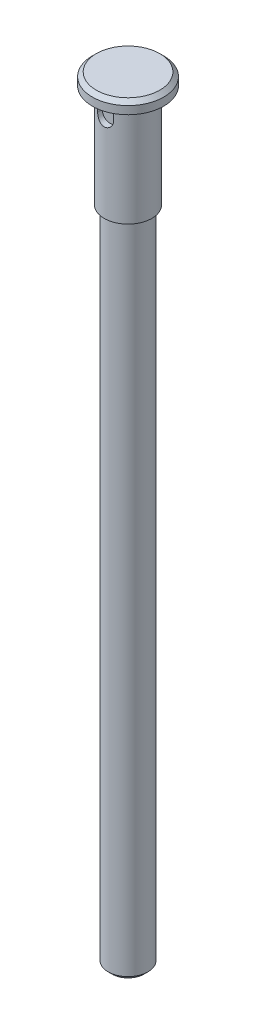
ISO-10303-21;
HEADER;
FILE_DESCRIPTION(('STEP AP214'),'2;1');
FILE_NAME('part.step','',(''),(''),'','','');
FILE_SCHEMA(('AUTOMOTIVE_DESIGN { 1 0 10303 214 1 1 1 1 }'));
ENDSEC;
DATA;
#1=APPLICATION_CONTEXT('core data for automotive mechanical design processes');
#2=APPLICATION_PROTOCOL_DEFINITION('international standard','automotive_design',2000,#1);
#3=PRODUCT_CONTEXT('',#1,'mechanical');
#4=PRODUCT('Part','Part','',(#3));
#5=PRODUCT_RELATED_PRODUCT_CATEGORY('part','',(#4));
#6=PRODUCT_DEFINITION_FORMATION('','',#4);
#7=PRODUCT_DEFINITION_CONTEXT('part definition',#1,'design');
#8=PRODUCT_DEFINITION('design','',#6,#7);
#9=PRODUCT_DEFINITION_SHAPE('','',#8);
#10=(LENGTH_UNIT() NAMED_UNIT(*) SI_UNIT(.MILLI.,.METRE.));
#11=(NAMED_UNIT(*) PLANE_ANGLE_UNIT() SI_UNIT($,.RADIAN.));
#12=(NAMED_UNIT(*) SI_UNIT($,.STERADIAN.) SOLID_ANGLE_UNIT());
#13=UNCERTAINTY_MEASURE_WITH_UNIT(LENGTH_MEASURE(1.E-05),#10,'distance_accuracy_value','');
#14=(GEOMETRIC_REPRESENTATION_CONTEXT(3) GLOBAL_UNCERTAINTY_ASSIGNED_CONTEXT((#13)) GLOBAL_UNIT_ASSIGNED_CONTEXT((#10,
#11,#12)) REPRESENTATION_CONTEXT('',''));
#15=CARTESIAN_POINT('',(0.,0.,0.));
#16=DIRECTION('',(0.,0.,1.));
#17=DIRECTION('',(1.,0.,0.));
#18=AXIS2_PLACEMENT_3D('',#15,#16,#17);
#19=CARTESIAN_POINT('',(0.,0.,0.));
#20=DIRECTION('',(0.,1.,0.));
#21=DIRECTION('',(0.,0.,1.));
#22=AXIS2_PLACEMENT_3D('',#19,#20,#21);
#23=PLANE('',#22);
#24=CARTESIAN_POINT('',(0.,0.,0.));
#25=DIRECTION('',(0.,-1.,0.));
#26=DIRECTION('',(0.,0.,-1.));
#27=AXIS2_PLACEMENT_3D('',#24,#25,#26);
#28=CIRCLE('',#27,4.);
#29=CARTESIAN_POINT('',(0.,0.,-4.));
#30=VERTEX_POINT('',#29);
#31=EDGE_CURVE('E472',#30,#30,#28,.T.);
#32=ORIENTED_EDGE('',*,*,#31,.T.);
#33=EDGE_LOOP('',(#32));
#34=FACE_BOUND('',#33,.T.);
#35=ADVANCED_FACE('F350',(#34),#23,.F.);
#36=CARTESIAN_POINT('',(0.,0.999999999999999,0.));
#37=DIRECTION('',(0.,1.,0.));
#38=DIRECTION('',(0.,0.,1.));
#39=AXIS2_PLACEMENT_3D('',#36,#37,#38);
#40=CONICAL_SURFACE('',#39,5.,0.785398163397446);
#41=ORIENTED_EDGE('',*,*,#31,.F.);
#42=EDGE_LOOP('',(#41));
#43=FACE_BOUND('',#42,.T.);
#44=CARTESIAN_POINT('',(0.,0.999999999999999,0.));
#45=DIRECTION('',(0.,-1.,0.));
#46=DIRECTION('',(0.,0.,-1.));
#47=AXIS2_PLACEMENT_3D('',#44,#45,#46);
#48=CIRCLE('',#47,5.);
#49=CARTESIAN_POINT('',(0.,0.999999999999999,-5.));
#50=VERTEX_POINT('',#49);
#51=EDGE_CURVE('E474',#50,#50,#48,.T.);
#52=ORIENTED_EDGE('',*,*,#51,.T.);
#53=EDGE_LOOP('',(#52));
#54=FACE_BOUND('',#53,.T.);
#55=ADVANCED_FACE('F463',(#43,#54),#40,.T.);
#56=CARTESIAN_POINT('',(0.,0.,0.));
#57=DIRECTION('',(0.,-1.,0.));
#58=DIRECTION('',(0.,0.,-1.));
#59=AXIS2_PLACEMENT_3D('',#56,#57,#58);
#60=CYLINDRICAL_SURFACE('',#59,5.);
#61=ORIENTED_EDGE('',*,*,#51,.F.);
#62=EDGE_LOOP('',(#61));
#63=FACE_BOUND('',#62,.T.);
#64=CARTESIAN_POINT('',(0.,166.,0.));
#65=DIRECTION('',(0.,-1.,0.));
#66=DIRECTION('',(0.,0.,-1.));
#67=AXIS2_PLACEMENT_3D('',#64,#65,#66);
#68=CIRCLE('',#67,5.);
#69=CARTESIAN_POINT('',(0.,166.,-5.));
#70=VERTEX_POINT('',#69);
#71=EDGE_CURVE('E478',#70,#70,#68,.T.);
#72=ORIENTED_EDGE('',*,*,#71,.T.);
#73=EDGE_LOOP('',(#72));
#74=FACE_BOUND('',#73,.T.);
#75=ADVANCED_FACE('F468',(#63,#74),#60,.T.);
#76=CARTESIAN_POINT('',(-5.,166.,0.));
#77=DIRECTION('',(0.,1.,0.));
#78=DIRECTION('',(0.,0.,1.));
#79=AXIS2_PLACEMENT_3D('',#76,#77,#78);
#80=PLANE('',#79);
#81=ORIENTED_EDGE('',*,*,#71,.F.);
#82=EDGE_LOOP('',(#81));
#83=FACE_BOUND('',#82,.T.);
#84=CARTESIAN_POINT('',(0.,166.,0.));
#85=DIRECTION('',(0.,-1.,0.));
#86=DIRECTION('',(0.,0.,-1.));
#87=AXIS2_PLACEMENT_3D('',#84,#85,#86);
#88=CIRCLE('',#87,6.);
#89=CARTESIAN_POINT('',(0.,166.,-6.));
#90=VERTEX_POINT('',#89);
#91=EDGE_CURVE('E554',#90,#90,#88,.T.);
#92=ORIENTED_EDGE('',*,*,#91,.T.);
#93=EDGE_LOOP('',(#92));
#94=FACE_BOUND('',#93,.T.);
#95=ADVANCED_FACE('F458',(#83,#94),#80,.F.);
#96=CARTESIAN_POINT('',(0.,0.,0.));
#97=DIRECTION('',(0.,-1.,0.));
#98=DIRECTION('',(0.,0.,-1.));
#99=AXIS2_PLACEMENT_3D('',#96,#97,#98);
#100=CYLINDRICAL_SURFACE('',#99,6.);
#101=ORIENTED_EDGE('',*,*,#91,.F.);
#102=EDGE_LOOP('',(#101));
#103=FACE_BOUND('',#102,.T.);
#104=DIRECTION('',(0.,-1.,0.));
#105=VECTOR('',#104,1.);
#106=CARTESIAN_POINT('',(-2.,0.,5.65685424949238));
#107=LINE('',#106,#105);
#108=CARTESIAN_POINT('',(-2.,188.,5.65685424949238));
#109=VERTEX_POINT('',#108);
#110=CARTESIAN_POINT('',(-2.,190.,5.65685424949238));
#111=VERTEX_POINT('',#110);
#112=EDGE_CURVE('E473',#109,#111,#107,.F.);
#113=ORIENTED_EDGE('',*,*,#112,.T.);
#114=CARTESIAN_POINT('',(0.,192.,6.));
#115=CARTESIAN_POINT('',(0.109126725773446,192.000000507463,6.00000030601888));
#116=CARTESIAN_POINT('',(0.218250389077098,191.991039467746,5.9969953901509));
#117=CARTESIAN_POINT('',(0.433283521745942,191.955541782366,5.98530420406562));
#118=CARTESIAN_POINT('',(0.539192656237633,191.929003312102,5.97661734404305));
#119=CARTESIAN_POINT('',(0.744665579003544,191.859361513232,5.95450615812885));
#120=CARTESIAN_POINT('',(0.844239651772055,191.816285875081,5.94108975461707));
#121=CARTESIAN_POINT('',(1.03474987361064,191.714917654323,5.91088891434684));
#122=CARTESIAN_POINT('',(1.12568431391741,191.656622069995,5.89410381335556));
#123=CARTESIAN_POINT('',(1.29948335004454,191.524348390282,5.8582818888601));
#124=CARTESIAN_POINT('',(1.38200740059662,191.449937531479,5.8391911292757));
#125=CARTESIAN_POINT('',(1.53366538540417,191.288465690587,5.80120629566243));
#126=CARTESIAN_POINT('',(1.60279637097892,191.201401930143,5.78231226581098));
#127=CARTESIAN_POINT('',(1.72764988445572,191.014029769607,5.74626664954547));
#128=CARTESIAN_POINT('',(1.78292971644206,190.913412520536,5.72918078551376));
#129=CARTESIAN_POINT('',(1.87563774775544,190.703647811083,5.69950610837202));
#130=CARTESIAN_POINT('',(1.91307139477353,190.594502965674,5.68691592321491));
#131=CARTESIAN_POINT('',(1.96774692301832,190.374653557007,5.66822606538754));
#132=CARTESIAN_POINT('',(1.98562689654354,190.264125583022,5.66192191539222));
#133=CARTESIAN_POINT('',(2.00268224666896,190.041472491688,5.65591313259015));
#134=CARTESIAN_POINT('',(2.00186340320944,189.929347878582,5.6562064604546));
#135=CARTESIAN_POINT('',(1.98203980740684,189.712126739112,5.6631803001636));
#136=CARTESIAN_POINT('',(1.96386782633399,189.606943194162,5.66956831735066));
#137=CARTESIAN_POINT('',(1.91121232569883,189.401213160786,5.68753315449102));
#138=CARTESIAN_POINT('',(1.87672685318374,189.30066722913,5.69911059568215));
#139=CARTESIAN_POINT('',(1.79187811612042,189.105174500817,5.72635822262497));
#140=CARTESIAN_POINT('',(1.74126809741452,189.010343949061,5.74209131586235));
#141=CARTESIAN_POINT('',(1.62577821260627,188.830258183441,5.77585117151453));
#142=CARTESIAN_POINT('',(1.56089422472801,188.745005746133,5.79387859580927));
#143=CARTESIAN_POINT('',(1.41469866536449,188.581816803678,5.83134658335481));
#144=CARTESIAN_POINT('',(1.33270630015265,188.504494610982,5.85081178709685));
#145=CARTESIAN_POINT('',(1.15667913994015,188.364537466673,5.88813876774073));
#146=CARTESIAN_POINT('',(1.06264319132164,188.301903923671,5.90600039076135));
#147=CARTESIAN_POINT('',(0.863895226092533,188.19260739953,5.93834215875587));
#148=CARTESIAN_POINT('',(0.75908655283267,188.146109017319,5.95278700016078));
#149=CARTESIAN_POINT('',(0.542538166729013,188.071593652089,5.9764113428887));
#150=CARTESIAN_POINT('',(0.430800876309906,188.043570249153,5.98559267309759));
#151=CARTESIAN_POINT('',(0.208767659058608,188.007888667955,5.99735254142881));
#152=CARTESIAN_POINT('',(0.0986191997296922,187.999400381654,6.00020003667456));
#153=CARTESIAN_POINT('',(-0.121550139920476,188.000665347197,5.99977805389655));
#154=CARTESIAN_POINT('',(-0.231571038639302,188.01041551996,5.99650960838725));
#155=CARTESIAN_POINT('',(-0.445039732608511,188.047223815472,5.98440049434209));
#156=CARTESIAN_POINT('',(-0.548585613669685,188.073772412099,5.97572397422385));
#157=CARTESIAN_POINT('',(-0.749711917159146,188.142786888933,5.9538369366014));
#158=CARTESIAN_POINT('',(-0.847291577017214,188.185254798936,5.9406258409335));
#159=CARTESIAN_POINT('',(-1.03657659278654,188.286140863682,5.91057862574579));
#160=CARTESIAN_POINT('',(-1.12805991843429,188.344949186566,5.89365629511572));
#161=CARTESIAN_POINT('',(-1.30012966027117,188.476388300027,5.85810507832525));
#162=CARTESIAN_POINT('',(-1.38071273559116,188.549023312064,5.83947567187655));
#163=CARTESIAN_POINT('',(-1.53250501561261,188.709957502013,5.80153695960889));
#164=CARTESIAN_POINT('',(-1.60312193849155,188.798818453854,5.78223522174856));
#165=CARTESIAN_POINT('',(-1.72851504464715,188.987543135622,5.74599946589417));
#166=CARTESIAN_POINT('',(-1.78329109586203,189.087406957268,5.72906546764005));
#167=CARTESIAN_POINT('',(-1.87519386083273,189.29534603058,5.69964783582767));
#168=CARTESIAN_POINT('',(-1.91235626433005,189.403404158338,5.68715521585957));
#169=CARTESIAN_POINT('',(-1.96778933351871,189.624757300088,5.66821664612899));
#170=CARTESIAN_POINT('',(-1.98606850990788,189.738049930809,5.66176797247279));
#171=CARTESIAN_POINT('',(-2.00255256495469,189.960394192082,5.65595717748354));
#172=CARTESIAN_POINT('',(-2.0017405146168,190.069364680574,5.6562480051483));
#173=CARTESIAN_POINT('',(-1.98248458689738,190.285530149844,5.66302539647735));
#174=CARTESIAN_POINT('',(-1.96404175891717,190.39272523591,5.66951159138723));
#175=CARTESIAN_POINT('',(-1.91074362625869,190.600271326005,5.68769048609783));
#176=CARTESIAN_POINT('',(-1.87620669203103,190.700713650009,5.69928196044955));
#177=CARTESIAN_POINT('',(-1.7919587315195,190.894454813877,5.72632797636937));
#178=CARTESIAN_POINT('',(-1.74224433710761,190.987752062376,5.74178337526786));
#179=CARTESIAN_POINT('',(-1.62652138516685,191.168967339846,5.77565658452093));
#180=CARTESIAN_POINT('',(-1.55989648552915,191.256473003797,5.79417423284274));
#181=CARTESIAN_POINT('',(-1.41328576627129,191.419379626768,5.83166712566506));
#182=CARTESIAN_POINT('',(-1.33329616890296,191.494777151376,5.85064249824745));
#183=CARTESIAN_POINT('',(-1.15848311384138,191.634288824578,5.88780061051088));
#184=CARTESIAN_POINT('',(-1.06320302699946,191.697848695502,5.90592363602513));
#185=CARTESIAN_POINT('',(-0.862714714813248,191.807980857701,5.93851982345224));
#186=CARTESIAN_POINT('',(-0.757509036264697,191.854557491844,5.9529939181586));
#187=CARTESIAN_POINT('',(-0.544987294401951,191.927443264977,5.97611030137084));
#188=CARTESIAN_POINT('',(-0.437975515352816,191.954564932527,5.98498424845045));
#189=CARTESIAN_POINT('',(-0.220640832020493,191.990840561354,5.99692814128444));
#190=CARTESIAN_POINT('',(-0.110318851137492,191.999999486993,5.9999996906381));
#191=CARTESIAN_POINT('',(0.,192.,6.));
#192=B_SPLINE_CURVE_WITH_KNOTS('',3,(#114,#115,#116,#117,#118,#119,#120,#121,#122,#123,#124,
#125,#126,#127,#128,#129,#130,#131,#132,#133,#134,#135,#136,#137,#138,#139,#140,#141,#142,#143,
#144,#145,#146,#147,#148,#149,#150,#151,#152,#153,#154,#155,#156,#157,#158,#159,#160,#161,#162,
#163,#164,#165,#166,#167,#168,#169,#170,#171,#172,#173,#174,#175,#176,#177,#178,#179,#180,#181,
#182,#183,#184,#185,#186,#187,#188,#189,#190,#191),.UNSPECIFIED.,.T.,.F.,(4,2,2,2,2,2,2,2,2,2,2,
2,2,2,2,2,2,2,2,2,2,2,2,2,2,2,2,2,2,2,2,2,2,2,2,2,2,2,4),(0.,0.32697421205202,0.653982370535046,
0.980445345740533,1.3069727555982,1.64369368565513,1.9804886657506,2.32696769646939,
2.67334089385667,3.00803851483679,3.34263267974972,3.66193653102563,3.98127861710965,
4.30576342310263,4.63034205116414,4.97186611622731,5.31342291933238,5.65836811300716,
6.00319337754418,6.3330716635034,6.66289426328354,6.98316315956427,7.30347290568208,
7.63220799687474,7.96104361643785,8.30482045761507,8.64860016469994,8.99168027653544,
9.33460569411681,9.6599133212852,9.98520158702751,10.3043117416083,10.6234927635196,
10.9566013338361,11.2898042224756,11.635993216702,11.9820936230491,12.3127311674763,
12.6432773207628),.UNSPECIFIED.);
#193=CARTESIAN_POINT('',(0.,192.,6.));
#194=VERTEX_POINT('',#193);
#195=EDGE_CURVE('E398',#111,#194,#192,.T.);
#196=ORIENTED_EDGE('',*,*,#195,.T.);
#197=CARTESIAN_POINT('',(0.,192.,0.));
#198=DIRECTION('',(0.,-1.,0.));
#199=DIRECTION('',(0.,0.,-1.));
#200=AXIS2_PLACEMENT_3D('',#197,#198,#199);
#201=CIRCLE('',#200,6.);
#202=EDGE_CURVE('E556',#194,#194,#201,.T.);
#203=ORIENTED_EDGE('',*,*,#202,.T.);
#204=CARTESIAN_POINT('',(2.,190.,5.65685424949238));
#205=VERTEX_POINT('',#204);
#206=EDGE_CURVE('E419',#194,#205,#192,.T.);
#207=ORIENTED_EDGE('',*,*,#206,.T.);
#208=DIRECTION('',(0.,-1.,0.));
#209=VECTOR('',#208,1.);
#210=CARTESIAN_POINT('',(2.,0.,5.65685424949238));
#211=LINE('',#210,#209);
#212=CARTESIAN_POINT('',(2.,188.,5.65685424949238));
#213=VERTEX_POINT('',#212);
#214=EDGE_CURVE('E11',#205,#213,#211,.T.);
#215=ORIENTED_EDGE('',*,*,#214,.T.);
#216=CARTESIAN_POINT('',(2.,188.,5.65685424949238));
#217=CARTESIAN_POINT('',(2.0000014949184,187.945419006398,5.65684884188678));
#218=CARTESIAN_POINT('',(1.99776424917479,187.890865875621,5.6576451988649));
#219=CARTESIAN_POINT('',(1.9888512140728,187.78218283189,5.66078654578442));
#220=CARTESIAN_POINT('',(1.98217662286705,187.728052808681,5.66313111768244));
#221=CARTESIAN_POINT('',(1.95562135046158,187.56721571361,5.67238184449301));
#222=CARTESIAN_POINT('',(1.92920846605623,187.461638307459,5.6815058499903));
#223=CARTESIAN_POINT('',(1.85991682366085,187.256749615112,5.70456149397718));
#224=CARTESIAN_POINT('',(1.81704715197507,187.157434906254,5.71849047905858));
#225=CARTESIAN_POINT('',(1.71614645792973,186.967320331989,5.74957574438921));
#226=CARTESIAN_POINT('',(1.65810612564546,186.876525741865,5.76673400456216));
#227=CARTESIAN_POINT('',(1.52610278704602,186.702559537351,5.80308960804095));
#228=CARTESIAN_POINT('',(1.45164996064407,186.619770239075,5.82233755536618));
#229=CARTESIAN_POINT('',(1.28997688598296,186.467587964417,5.86027697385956));
#230=CARTESIAN_POINT('',(1.20275436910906,186.398197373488,5.87896834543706));
#231=CARTESIAN_POINT('',(1.01520729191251,186.273040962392,5.91427765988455));
#232=CARTESIAN_POINT('',(0.914600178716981,186.217678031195,5.93082875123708));
#233=CARTESIAN_POINT('',(0.704858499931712,186.124815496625,5.95939217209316));
#234=CARTESIAN_POINT('',(0.595726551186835,186.087310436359,5.97140588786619));
#235=CARTESIAN_POINT('',(0.376058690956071,186.032528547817,5.98918142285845));
#236=CARTESIAN_POINT('',(0.265703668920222,186.014593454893,5.99514617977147));
#237=CARTESIAN_POINT('',(0.0433979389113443,185.997367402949,6.00087216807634));
#238=CARTESIAN_POINT('',(-0.0685523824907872,185.998072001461,6.00063487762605));
#239=CARTESIAN_POINT('',(-0.286207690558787,186.017688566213,5.99412077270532));
#240=CARTESIAN_POINT('',(-0.391985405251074,186.035885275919,5.98808121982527));
#241=CARTESIAN_POINT('',(-0.598888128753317,186.088786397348,5.97093921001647));
#242=CARTESIAN_POINT('',(-0.700012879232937,186.123491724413,5.95983647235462));
#243=CARTESIAN_POINT('',(-0.896305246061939,186.208842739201,5.93351336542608));
#244=CARTESIAN_POINT('',(-0.991377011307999,186.259692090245,5.91824075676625));
#245=CARTESIAN_POINT('',(-1.17184917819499,186.375719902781,5.88516775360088));
#246=CARTESIAN_POINT('',(-1.25724693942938,186.440902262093,5.86736667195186));
#247=CARTESIAN_POINT('',(-1.42019467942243,186.587342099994,5.83012543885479));
#248=CARTESIAN_POINT('',(-1.4971872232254,186.669211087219,5.81064757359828));
#249=CARTESIAN_POINT('',(-1.63654404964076,186.844882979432,5.77294980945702));
#250=CARTESIAN_POINT('',(-1.69890360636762,186.938689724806,5.75473031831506));
#251=CARTESIAN_POINT('',(-1.80800665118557,187.137360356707,5.72140062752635));
#252=CARTESIAN_POINT('',(-1.85450601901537,187.242367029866,5.70634029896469));
#253=CARTESIAN_POINT('',(-1.92892046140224,187.45929395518,5.68162194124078));
#254=CARTESIAN_POINT('',(-1.95686487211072,187.571202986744,5.67195538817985));
#255=CARTESIAN_POINT('',(-1.98331631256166,187.736837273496,5.6627308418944));
#256=CARTESIAN_POINT('',(-1.98957012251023,187.789282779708,5.66053335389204));
#257=CARTESIAN_POINT('',(-1.99790923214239,187.8944761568,5.65759407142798));
#258=CARTESIAN_POINT('',(-1.99999991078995,187.947223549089,5.65685039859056));
#259=CARTESIAN_POINT('',(-2.,188.,5.65685424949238));
#260=B_SPLINE_CURVE_WITH_KNOTS('',3,(#216,#217,#218,#219,#220,#221,#222,#223,#224,#225,#226,
#227,#228,#229,#230,#231,#232,#233,#234,#235,#236,#237,#238,#239,#240,#241,#242,#243,#244,#245,
#246,#247,#248,#249,#250,#251,#252,#253,#254,#255,#256,#257,#258,#259),.UNSPECIFIED.,.F.,.F.,(4,
2,2,2,2,2,2,2,2,2,2,2,2,2,2,2,2,2,2,2,2,4),(0.,0.163636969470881,0.327229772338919,
0.653162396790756,0.978915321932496,1.30486862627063,1.64233009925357,1.97985159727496,
2.32618265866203,2.67240782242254,3.00658941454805,3.34069136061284,3.6616883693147,
3.98270317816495,4.30794037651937,4.63326613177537,4.97388108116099,5.31460588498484,
5.66036059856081,6.0055673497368,6.16399790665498,6.32222363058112),.UNSPECIFIED.);
#261=EDGE_CURVE('E357',#213,#109,#260,.T.);
#262=ORIENTED_EDGE('',*,*,#261,.T.);
#263=EDGE_LOOP('',(#113,#196,#203,#207,#215,#262));
#264=FACE_BOUND('',#263,.T.);
#265=ADVANCED_FACE('F431',(#103,#264),#100,.T.);
#266=CARTESIAN_POINT('',(-6.,192.,0.));
#267=DIRECTION('',(0.,1.,0.));
#268=DIRECTION('',(0.,0.,1.));
#269=AXIS2_PLACEMENT_3D('',#266,#267,#268);
#270=PLANE('',#269);
#271=ORIENTED_EDGE('',*,*,#202,.F.);
#272=EDGE_LOOP('',(#271));
#273=FACE_BOUND('',#272,.T.);
#274=CARTESIAN_POINT('',(0.,192.,0.));
#275=DIRECTION('',(0.,-1.,0.));
#276=DIRECTION('',(0.,0.,-1.));
#277=AXIS2_PLACEMENT_3D('',#274,#275,#276);
#278=CIRCLE('',#277,9.);
#279=CARTESIAN_POINT('',(0.,192.,-9.));
#280=VERTEX_POINT('',#279);
#281=EDGE_CURVE('E561',#280,#280,#278,.T.);
#282=ORIENTED_EDGE('',*,*,#281,.T.);
#283=EDGE_LOOP('',(#282));
#284=FACE_BOUND('',#283,.T.);
#285=ADVANCED_FACE('F451',(#273,#284),#270,.F.);
#286=CARTESIAN_POINT('',(0.,0.,0.));
#287=DIRECTION('',(0.,-1.,0.));
#288=DIRECTION('',(0.,0.,-1.));
#289=AXIS2_PLACEMENT_3D('',#286,#287,#288);
#290=CYLINDRICAL_SURFACE('',#289,9.);
#291=ORIENTED_EDGE('',*,*,#281,.F.);
#292=EDGE_LOOP('',(#291));
#293=FACE_BOUND('',#292,.T.);
#294=CARTESIAN_POINT('',(0.,194.,0.));
#295=DIRECTION('',(0.,-1.,0.));
#296=DIRECTION('',(0.,0.,-1.));
#297=AXIS2_PLACEMENT_3D('',#294,#295,#296);
#298=CIRCLE('',#297,9.);
#299=CARTESIAN_POINT('',(0.,194.,-9.));
#300=VERTEX_POINT('',#299);
#301=EDGE_CURVE('E563',#300,#300,#298,.T.);
#302=ORIENTED_EDGE('',*,*,#301,.T.);
#303=EDGE_LOOP('',(#302));
#304=FACE_BOUND('',#303,.T.);
#305=ADVANCED_FACE('F448',(#293,#304),#290,.T.);
#306=CARTESIAN_POINT('',(0.,195.,0.));
#307=DIRECTION('',(0.,-1.,0.));
#308=DIRECTION('',(0.,0.,-1.));
#309=AXIS2_PLACEMENT_3D('',#306,#307,#308);
#310=CONICAL_SURFACE('',#309,8.,0.785398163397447);
#311=ORIENTED_EDGE('',*,*,#301,.F.);
#312=EDGE_LOOP('',(#311));
#313=FACE_BOUND('',#312,.T.);
#314=CARTESIAN_POINT('',(0.,195.,0.));
#315=DIRECTION('',(0.,-1.,0.));
#316=DIRECTION('',(0.,0.,-1.));
#317=AXIS2_PLACEMENT_3D('',#314,#315,#316);
#318=CIRCLE('',#317,8.);
#319=CARTESIAN_POINT('',(0.,195.,-8.));
#320=VERTEX_POINT('',#319);
#321=EDGE_CURVE('E429',#320,#320,#318,.T.);
#322=ORIENTED_EDGE('',*,*,#321,.T.);
#323=EDGE_LOOP('',(#322));
#324=FACE_BOUND('',#323,.T.);
#325=ADVANCED_FACE('F444',(#313,#324),#310,.T.);
#326=CARTESIAN_POINT('',(-8.,195.,0.));
#327=DIRECTION('',(0.,-1.,0.));
#328=DIRECTION('',(0.,0.,-1.));
#329=AXIS2_PLACEMENT_3D('',#326,#327,#328);
#330=PLANE('',#329);
#331=ORIENTED_EDGE('',*,*,#321,.F.);
#332=EDGE_LOOP('',(#331));
#333=FACE_BOUND('',#332,.T.);
#334=ADVANCED_FACE('F440',(#333),#330,.F.);
#335=CARTESIAN_POINT('',(2.,190.,4.5));
#336=DIRECTION('',(1.,0.,0.));
#337=DIRECTION('',(0.,0.,-1.));
#338=AXIS2_PLACEMENT_3D('',#335,#336,#337);
#339=PLANE('',#338);
#340=DIRECTION('',(0.,0.,1.));
#341=VECTOR('',#340,1.);
#342=CARTESIAN_POINT('',(2.,190.,4.5));
#343=LINE('',#342,#341);
#344=CARTESIAN_POINT('',(2.,190.,4.5));
#345=VERTEX_POINT('',#344);
#346=EDGE_CURVE('E417',#345,#205,#343,.T.);
#347=ORIENTED_EDGE('',*,*,#346,.F.);
#348=DIRECTION('',(0.,1.,0.));
#349=VECTOR('',#348,1.);
#350=CARTESIAN_POINT('',(2.,190.,4.5));
#351=LINE('',#350,#349);
#352=CARTESIAN_POINT('',(2.,188.,4.5));
#353=VERTEX_POINT('',#352);
#354=EDGE_CURVE('E401',#353,#345,#351,.T.);
#355=ORIENTED_EDGE('',*,*,#354,.F.);
#356=DIRECTION('',(0.,0.,1.));
#357=VECTOR('',#356,1.);
#358=CARTESIAN_POINT('',(2.,188.,4.5));
#359=LINE('',#358,#357);
#360=EDGE_CURVE('E420',#353,#213,#359,.T.);
#361=ORIENTED_EDGE('',*,*,#360,.T.);
#362=ORIENTED_EDGE('',*,*,#214,.F.);
#363=EDGE_LOOP('',(#347,#355,#361,#362));
#364=FACE_BOUND('',#363,.T.);
#365=ADVANCED_FACE('F443',(#364),#339,.F.);
#366=CARTESIAN_POINT('',(0.,188.,4.5));
#367=DIRECTION('',(0.,0.,1.));
#368=DIRECTION('',(1.,0.,0.));
#369=AXIS2_PLACEMENT_3D('',#366,#367,#368);
#370=CYLINDRICAL_SURFACE('',#369,2.);
#371=ORIENTED_EDGE('',*,*,#360,.F.);
#372=CARTESIAN_POINT('',(0.,188.,4.5));
#373=DIRECTION('',(0.,0.,1.));
#374=DIRECTION('',(1.,0.,0.));
#375=AXIS2_PLACEMENT_3D('',#372,#373,#374);
#376=CIRCLE('',#375,2.);
#377=CARTESIAN_POINT('',(-2.,188.,4.5));
#378=VERTEX_POINT('',#377);
#379=EDGE_CURVE('E409',#378,#353,#376,.T.);
#380=ORIENTED_EDGE('',*,*,#379,.F.);
#381=DIRECTION('',(0.,0.,1.));
#382=VECTOR('',#381,1.);
#383=CARTESIAN_POINT('',(-2.,188.,4.5));
#384=LINE('',#383,#382);
#385=EDGE_CURVE('E400',#378,#109,#384,.T.);
#386=ORIENTED_EDGE('',*,*,#385,.T.);
#387=ORIENTED_EDGE('',*,*,#261,.F.);
#388=EDGE_LOOP('',(#371,#380,#386,#387));
#389=FACE_BOUND('',#388,.T.);
#390=ADVANCED_FACE('F484',(#389),#370,.F.);
#391=CARTESIAN_POINT('',(-2.,190.,4.5));
#392=DIRECTION('',(-1.,0.,0.));
#393=DIRECTION('',(0.,0.,1.));
#394=AXIS2_PLACEMENT_3D('',#391,#392,#393);
#395=PLANE('',#394);
#396=ORIENTED_EDGE('',*,*,#385,.F.);
#397=DIRECTION('',(0.,-1.,0.));
#398=VECTOR('',#397,1.);
#399=CARTESIAN_POINT('',(-2.,190.,4.5));
#400=LINE('',#399,#398);
#401=CARTESIAN_POINT('',(-2.,190.,4.5));
#402=VERTEX_POINT('',#401);
#403=EDGE_CURVE('E404',#402,#378,#400,.T.);
#404=ORIENTED_EDGE('',*,*,#403,.F.);
#405=DIRECTION('',(0.,0.,1.));
#406=VECTOR('',#405,1.);
#407=CARTESIAN_POINT('',(-2.,190.,4.5));
#408=LINE('',#407,#406);
#409=EDGE_CURVE('E364',#402,#111,#408,.T.);
#410=ORIENTED_EDGE('',*,*,#409,.T.);
#411=ORIENTED_EDGE('',*,*,#112,.F.);
#412=EDGE_LOOP('',(#396,#404,#410,#411));
#413=FACE_BOUND('',#412,.T.);
#414=ADVANCED_FACE('F405',(#413),#395,.F.);
#415=CARTESIAN_POINT('',(0.,190.,4.5));
#416=DIRECTION('',(0.,0.,1.));
#417=DIRECTION('',(1.,0.,0.));
#418=AXIS2_PLACEMENT_3D('',#415,#416,#417);
#419=CYLINDRICAL_SURFACE('',#418,2.);
#420=ORIENTED_EDGE('',*,*,#409,.F.);
#421=CARTESIAN_POINT('',(0.,190.,4.5));
#422=DIRECTION('',(0.,0.,1.));
#423=DIRECTION('',(1.,0.,0.));
#424=AXIS2_PLACEMENT_3D('',#421,#422,#423);
#425=CIRCLE('',#424,2.);
#426=EDGE_CURVE('E395',#345,#402,#425,.T.);
#427=ORIENTED_EDGE('',*,*,#426,.F.);
#428=ORIENTED_EDGE('',*,*,#346,.T.);
#429=ORIENTED_EDGE('',*,*,#206,.F.);
#430=ORIENTED_EDGE('',*,*,#195,.F.);
#431=EDGE_LOOP('',(#420,#427,#428,#429,#430));
#432=FACE_BOUND('',#431,.T.);
#433=ADVANCED_FACE('F392',(#432),#419,.F.);
#434=CARTESIAN_POINT('',(0.,190.,4.5));
#435=DIRECTION('',(0.,0.,1.));
#436=DIRECTION('',(1.,0.,0.));
#437=AXIS2_PLACEMENT_3D('',#434,#435,#436);
#438=PLANE('',#437);
#439=ORIENTED_EDGE('',*,*,#426,.T.);
#440=ORIENTED_EDGE('',*,*,#403,.T.);
#441=ORIENTED_EDGE('',*,*,#379,.T.);
#442=ORIENTED_EDGE('',*,*,#354,.T.);
#443=EDGE_LOOP('',(#439,#440,#441,#442));
#444=FACE_BOUND('',#443,.T.);
#445=ADVANCED_FACE('F411',(#444),#438,.T.);
#446=CLOSED_SHELL('',(#35,#55,#75,#95,#265,#285,#305,#325,#334,#365,#390,#414,#433,#445));
#447=MANIFOLD_SOLID_BREP('B2',#446);
#448=ADVANCED_BREP_SHAPE_REPRESENTATION('',(#18,#447),#14);
#449=SHAPE_DEFINITION_REPRESENTATION(#9,#448);
ENDSEC;
END-ISO-10303-21;
